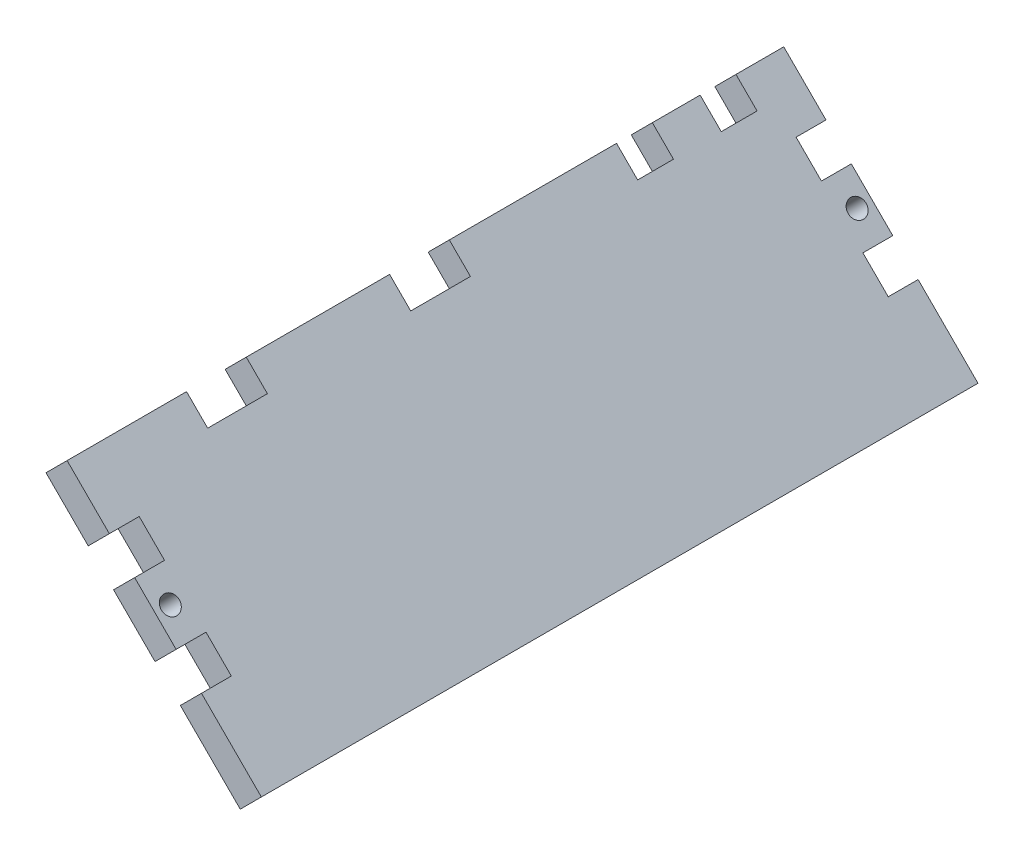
from build123d import *

# Parameters (mm, degrees)
SKETCH7_R           = 1.905
BOSS_EXTRUDE4_DEPTH = 6.35


with BuildPart() as part:
    # Sketch7 → Boss-Extrude4 (new body)
    with BuildSketch(Plane(origin=(0, 0, 0), x_dir=(-0.7071067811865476, 0.7071067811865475, 0), z_dir=(-0.7071067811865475, -0.7071067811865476, 0))):
        Polygon((58.42, -10.16), (58.42, 0), (45.72, 0), (45.72, -6.35), (38.1, -6.35), (38.1, 0), (25.63114, 0), (25.63114, -6.35), (18.01114, -6.35), (18.01114, 0), (0, 0), (0, -152.4), (18.01114, -152.4), (18.01114, -146.05), (25.63114, -146.05), (25.63114, -152.4), (38.1, -152.4), (38.1, -146.05), (45.72, -146.05), (45.72, -152.4), (58.42, -152.4), (58.42, -127), (52.07, -127), (52.07, -114.3), (58.42, -114.3), (58.42, -83.82), (52.07, -83.82), (52.07, -71.12), (58.42, -71.12), (58.42, -35.56), (52.07, -35.56), (52.07, -27.94), (58.42, -27.94), (58.42, -17.78), (52.07, -17.78), (52.07, -10.16), align=None)
        with Locations(Location((31.86557, -149.225, 0), (0, 0, 180))):
            Circle(SKETCH7_R, mode=Mode.SUBTRACT)
        with Locations(Location((31.86557, -3.175, 0), (0, 0, 180))):
            Circle(SKETCH7_R, mode=Mode.SUBTRACT)
    extrude(amount=BOSS_EXTRUDE4_DEPTH)


solid = part.part
